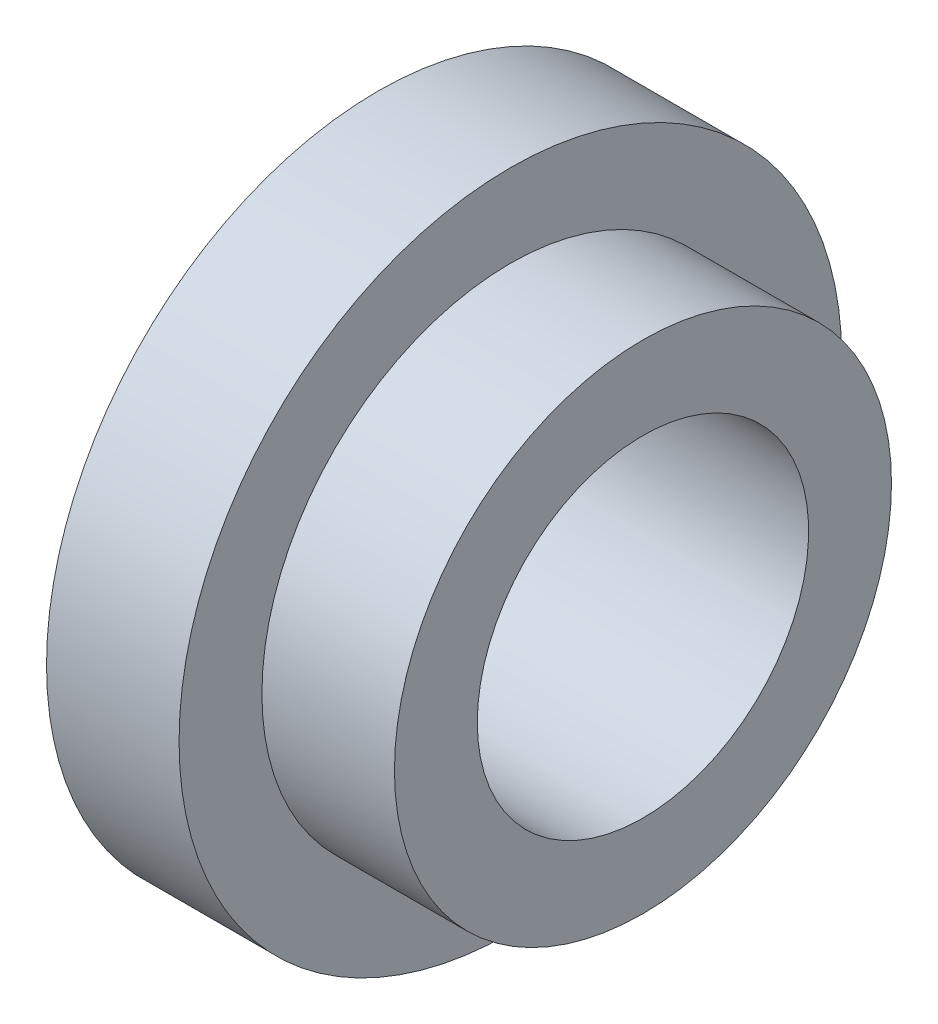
ISO-10303-21;
HEADER;
FILE_DESCRIPTION(('STEP AP214'),'2;1');
FILE_NAME('part.step','',(''),(''),'','','');
FILE_SCHEMA(('AUTOMOTIVE_DESIGN { 1 0 10303 214 1 1 1 1 }'));
ENDSEC;
DATA;
#1=APPLICATION_CONTEXT('core data for automotive mechanical design processes');
#2=APPLICATION_PROTOCOL_DEFINITION('international standard','automotive_design',2000,#1);
#3=PRODUCT_CONTEXT('',#1,'mechanical');
#4=PRODUCT('Part','Part','',(#3));
#5=PRODUCT_RELATED_PRODUCT_CATEGORY('part','',(#4));
#6=PRODUCT_DEFINITION_FORMATION('','',#4);
#7=PRODUCT_DEFINITION_CONTEXT('part definition',#1,'design');
#8=PRODUCT_DEFINITION('design','',#6,#7);
#9=PRODUCT_DEFINITION_SHAPE('','',#8);
#10=(LENGTH_UNIT() NAMED_UNIT(*) SI_UNIT(.MILLI.,.METRE.));
#11=(NAMED_UNIT(*) PLANE_ANGLE_UNIT() SI_UNIT($,.RADIAN.));
#12=(NAMED_UNIT(*) SI_UNIT($,.STERADIAN.) SOLID_ANGLE_UNIT());
#13=UNCERTAINTY_MEASURE_WITH_UNIT(LENGTH_MEASURE(1.E-05),#10,'distance_accuracy_value','');
#14=(GEOMETRIC_REPRESENTATION_CONTEXT(3) GLOBAL_UNCERTAINTY_ASSIGNED_CONTEXT((#13)) GLOBAL_UNIT_ASSIGNED_CONTEXT((#10,
#11,#12)) REPRESENTATION_CONTEXT('',''));
#15=CARTESIAN_POINT('',(0.,0.,0.));
#16=DIRECTION('',(0.,0.,1.));
#17=DIRECTION('',(1.,0.,0.));
#18=AXIS2_PLACEMENT_3D('',#15,#16,#17);
#19=CARTESIAN_POINT('',(0.,0.,0.));
#20=DIRECTION('',(-1.,0.,0.));
#21=DIRECTION('',(0.,0.,1.));
#22=AXIS2_PLACEMENT_3D('',#19,#20,#21);
#23=CYLINDRICAL_SURFACE('',#22,25.);
#24=CARTESIAN_POINT('',(40.,0.,0.));
#25=DIRECTION('',(-1.,0.,0.));
#26=DIRECTION('',(0.,0.,1.));
#27=AXIS2_PLACEMENT_3D('',#24,#25,#26);
#28=CIRCLE('',#27,25.);
#29=CARTESIAN_POINT('',(40.,0.,25.));
#30=VERTEX_POINT('',#29);
#31=EDGE_CURVE('E52',#30,#30,#28,.T.);
#32=ORIENTED_EDGE('',*,*,#31,.F.);
#33=EDGE_LOOP('',(#32));
#34=FACE_BOUND('',#33,.T.);
#35=CARTESIAN_POINT('',(0.,0.,0.));
#36=DIRECTION('',(-1.,0.,0.));
#37=DIRECTION('',(0.,0.,1.));
#38=AXIS2_PLACEMENT_3D('',#35,#36,#37);
#39=CIRCLE('',#38,25.);
#40=CARTESIAN_POINT('',(0.,0.,25.));
#41=VERTEX_POINT('',#40);
#42=EDGE_CURVE('E10',#41,#41,#39,.T.);
#43=ORIENTED_EDGE('',*,*,#42,.T.);
#44=EDGE_LOOP('',(#43));
#45=FACE_BOUND('',#44,.T.);
#46=ADVANCED_FACE('F30',(#34,#45),#23,.F.);
#47=CARTESIAN_POINT('',(0.,25.,0.));
#48=DIRECTION('',(1.,0.,0.));
#49=DIRECTION('',(0.,0.,-1.));
#50=AXIS2_PLACEMENT_3D('',#47,#48,#49);
#51=PLANE('',#50);
#52=ORIENTED_EDGE('',*,*,#42,.F.);
#53=EDGE_LOOP('',(#52));
#54=FACE_BOUND('',#53,.T.);
#55=CARTESIAN_POINT('',(0.,0.,0.));
#56=DIRECTION('',(-1.,0.,0.));
#57=DIRECTION('',(0.,0.,1.));
#58=AXIS2_PLACEMENT_3D('',#55,#56,#57);
#59=CIRCLE('',#58,50.);
#60=CARTESIAN_POINT('',(0.,0.,50.));
#61=VERTEX_POINT('',#60);
#62=EDGE_CURVE('E36',#61,#61,#59,.T.);
#63=ORIENTED_EDGE('',*,*,#62,.T.);
#64=EDGE_LOOP('',(#63));
#65=FACE_BOUND('',#64,.T.);
#66=ADVANCED_FACE('F59',(#54,#65),#51,.F.);
#67=CARTESIAN_POINT('',(0.,0.,0.));
#68=DIRECTION('',(-1.,0.,0.));
#69=DIRECTION('',(0.,0.,1.));
#70=AXIS2_PLACEMENT_3D('',#67,#68,#69);
#71=CYLINDRICAL_SURFACE('',#70,50.);
#72=ORIENTED_EDGE('',*,*,#62,.F.);
#73=EDGE_LOOP('',(#72));
#74=FACE_BOUND('',#73,.T.);
#75=CARTESIAN_POINT('',(20.,0.,0.));
#76=DIRECTION('',(-1.,0.,0.));
#77=DIRECTION('',(0.,0.,1.));
#78=AXIS2_PLACEMENT_3D('',#75,#76,#77);
#79=CIRCLE('',#78,50.);
#80=CARTESIAN_POINT('',(20.,0.,50.));
#81=VERTEX_POINT('',#80);
#82=EDGE_CURVE('E40',#81,#81,#79,.T.);
#83=ORIENTED_EDGE('',*,*,#82,.T.);
#84=EDGE_LOOP('',(#83));
#85=FACE_BOUND('',#84,.T.);
#86=ADVANCED_FACE('F63',(#74,#85),#71,.T.);
#87=CARTESIAN_POINT('',(20.,50.,0.));
#88=DIRECTION('',(-1.,0.,0.));
#89=DIRECTION('',(0.,0.,1.));
#90=AXIS2_PLACEMENT_3D('',#87,#88,#89);
#91=PLANE('',#90);
#92=ORIENTED_EDGE('',*,*,#82,.F.);
#93=EDGE_LOOP('',(#92));
#94=FACE_BOUND('',#93,.T.);
#95=CARTESIAN_POINT('',(20.,0.,0.));
#96=DIRECTION('',(-1.,0.,0.));
#97=DIRECTION('',(0.,0.,1.));
#98=AXIS2_PLACEMENT_3D('',#95,#96,#97);
#99=CIRCLE('',#98,37.5);
#100=CARTESIAN_POINT('',(20.,0.,37.5));
#101=VERTEX_POINT('',#100);
#102=EDGE_CURVE('E44',#101,#101,#99,.T.);
#103=ORIENTED_EDGE('',*,*,#102,.T.);
#104=EDGE_LOOP('',(#103));
#105=FACE_BOUND('',#104,.T.);
#106=ADVANCED_FACE('F68',(#94,#105),#91,.F.);
#107=CARTESIAN_POINT('',(0.,0.,0.));
#108=DIRECTION('',(-1.,0.,0.));
#109=DIRECTION('',(0.,0.,1.));
#110=AXIS2_PLACEMENT_3D('',#107,#108,#109);
#111=CYLINDRICAL_SURFACE('',#110,37.5);
#112=ORIENTED_EDGE('',*,*,#102,.F.);
#113=EDGE_LOOP('',(#112));
#114=FACE_BOUND('',#113,.T.);
#115=CARTESIAN_POINT('',(40.,0.,0.));
#116=DIRECTION('',(-1.,0.,0.));
#117=DIRECTION('',(0.,0.,1.));
#118=AXIS2_PLACEMENT_3D('',#115,#116,#117);
#119=CIRCLE('',#118,37.5);
#120=CARTESIAN_POINT('',(40.,0.,37.5));
#121=VERTEX_POINT('',#120);
#122=EDGE_CURVE('E49',#121,#121,#119,.T.);
#123=ORIENTED_EDGE('',*,*,#122,.T.);
#124=EDGE_LOOP('',(#123));
#125=FACE_BOUND('',#124,.T.);
#126=ADVANCED_FACE('F74',(#114,#125),#111,.T.);
#127=CARTESIAN_POINT('',(40.,37.5,0.));
#128=DIRECTION('',(-1.,0.,0.));
#129=DIRECTION('',(0.,0.,1.));
#130=AXIS2_PLACEMENT_3D('',#127,#128,#129);
#131=PLANE('',#130);
#132=ORIENTED_EDGE('',*,*,#122,.F.);
#133=EDGE_LOOP('',(#132));
#134=FACE_BOUND('',#133,.T.);
#135=ORIENTED_EDGE('',*,*,#31,.T.);
#136=EDGE_LOOP('',(#135));
#137=FACE_BOUND('',#136,.T.);
#138=ADVANCED_FACE('F56',(#134,#137),#131,.F.);
#139=CLOSED_SHELL('',(#46,#66,#86,#106,#126,#138));
#140=MANIFOLD_SOLID_BREP('B2',#139);
#141=ADVANCED_BREP_SHAPE_REPRESENTATION('',(#18,#140),#14);
#142=SHAPE_DEFINITION_REPRESENTATION(#9,#141);
ENDSEC;
END-ISO-10303-21;
